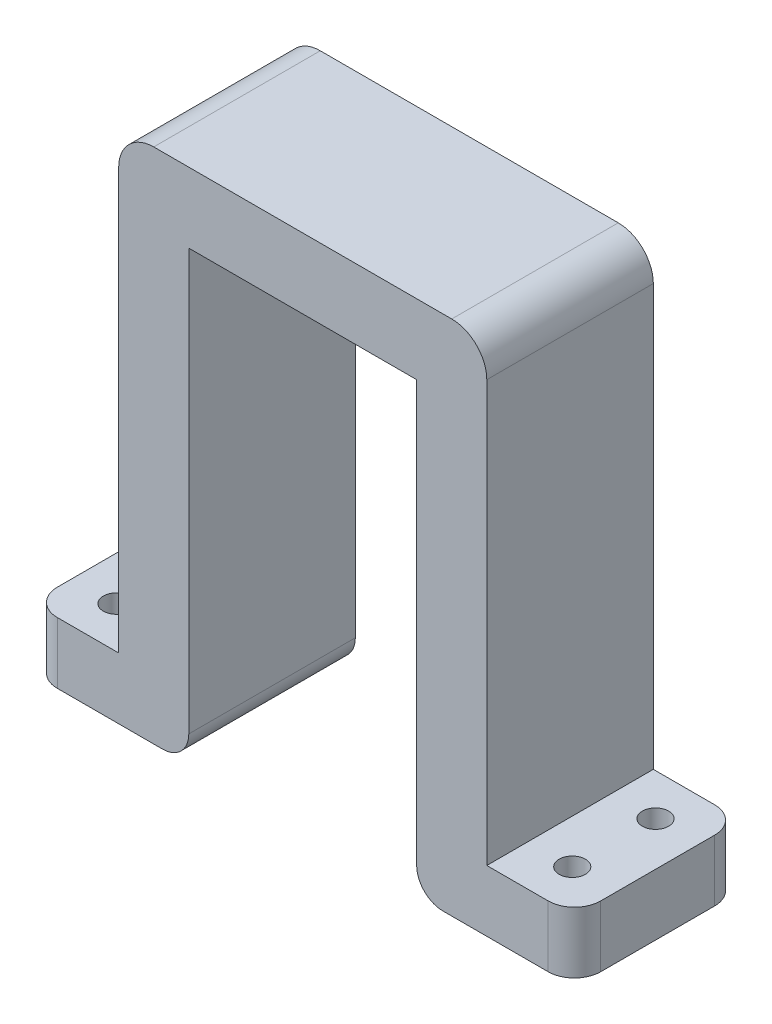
from build123d import *

# Parameters (mm, degrees)
BOSS_EXTRUDE1_DEPTH = 19
SKETCH3_W           = 19
SKETCH3_H           = 7
BOSS_EXTRUDE2_DEPTH = 10
SKETCH2_W           = 19
SKETCH2_H           = 7
BOSS_EXTRUDE3_DEPTH = 10
SKETCH6_R           = 1.5
CUT_EXTRUDE1_DEPTH  = 65.054031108
SKETCH5_R           = 1.5
CUT_EXTRUDE2_DEPTH  = 65.054031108
FILLET1_R           = 3
FILLET2_R           = 4
FILLET3_R           = 3


with BuildPart() as part:
    # Sketch1 → Boss-Extrude1 (new body)
    with BuildSketch(Plane.XY):
        Polygon((-11.783251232, 7.492610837), (14.216748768, 7.492610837), (14.216748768, -43.507389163), (22.216748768, -43.507389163), (22.216748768, 15.492610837), (-19.783251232, 15.492610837), (-19.783251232, -43.507389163), (-11.783251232, -43.507389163), align=None)
    extrude(amount=BOSS_EXTRUDE1_DEPTH)

    # Sketch3 → Boss-Extrude2 (add)
    with BuildSketch(Plane.ZY.offset(19.783251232)):
        with Locations((9.5, -40.007389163)):
            Rectangle(SKETCH3_W, SKETCH3_H)
    extrude(amount=BOSS_EXTRUDE2_DEPTH)

    # Sketch2 → Boss-Extrude3 (add)
    with BuildSketch(Plane(origin=(22.216748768, 0, 0), x_dir=(0, 0, -1), z_dir=(1, 0, 0))):
        with Locations((-9.5, -40.007389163)):
            Rectangle(SKETCH2_W, SKETCH2_H)
    extrude(amount=BOSS_EXTRUDE3_DEPTH)

    # Sketch6 → Cut-Extrude1 (cut, through all)
    with BuildSketch(Plane(origin=(0, -36.507389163, 0), x_dir=(1, 0, 0), z_dir=(0, 1, 0))):
        with Locations(Location((27.216748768, -14.25, 0), (0, 0, 270))):
            Circle(SKETCH6_R)
        with Locations(Location((27.216748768, -4.75, 0), (0, 0, 270))):
            Circle(SKETCH6_R)
    extrude(amount=-CUT_EXTRUDE1_DEPTH, mode=Mode.SUBTRACT)

    # Sketch5 → Cut-Extrude2 (cut, through all)
    with BuildSketch(Plane(origin=(0, -36.507389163, 0), x_dir=(1, 0, 0), z_dir=(0, 1, 0))):
        with Locations(Location((-24.783251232, -4.75, 0), (0, 0, 270))):
            Circle(SKETCH5_R)
        with Locations(Location((-24.783251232, -14.25, 0), (0, 0, 270))):
            Circle(SKETCH5_R)
    extrude(amount=-CUT_EXTRUDE2_DEPTH, mode=Mode.SUBTRACT)

    # Fillet1
    fillet1_edges = [part.edges().sort_by_distance(p)[0] for p in [
        (-29.783251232, -40.007389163, 0),
        (-29.783251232, -40.007389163, 19),
        (32.216748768, -40.007389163, 19),
        (32.216748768, -40.007389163, 0),
    ]]
    fillet(fillet1_edges, radius=FILLET1_R)

    # Fillet2
    fillet2_edges = [part.edges().sort_by_distance(p)[0] for p in [
        (22.216748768, 15.492610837, 9.5),
        (-19.783251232, 15.492610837, 9.5),
    ]]
    fillet(fillet2_edges, radius=FILLET2_R)

    # Fillet3
    fillet3_edges = [part.edges().sort_by_distance(p)[0] for p in [
        (-11.783251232, -43.507389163, 9.5),
        (14.216748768, -43.507389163, 9.5),
    ]]
    fillet(fillet3_edges, radius=FILLET3_R)


solid = part.part
